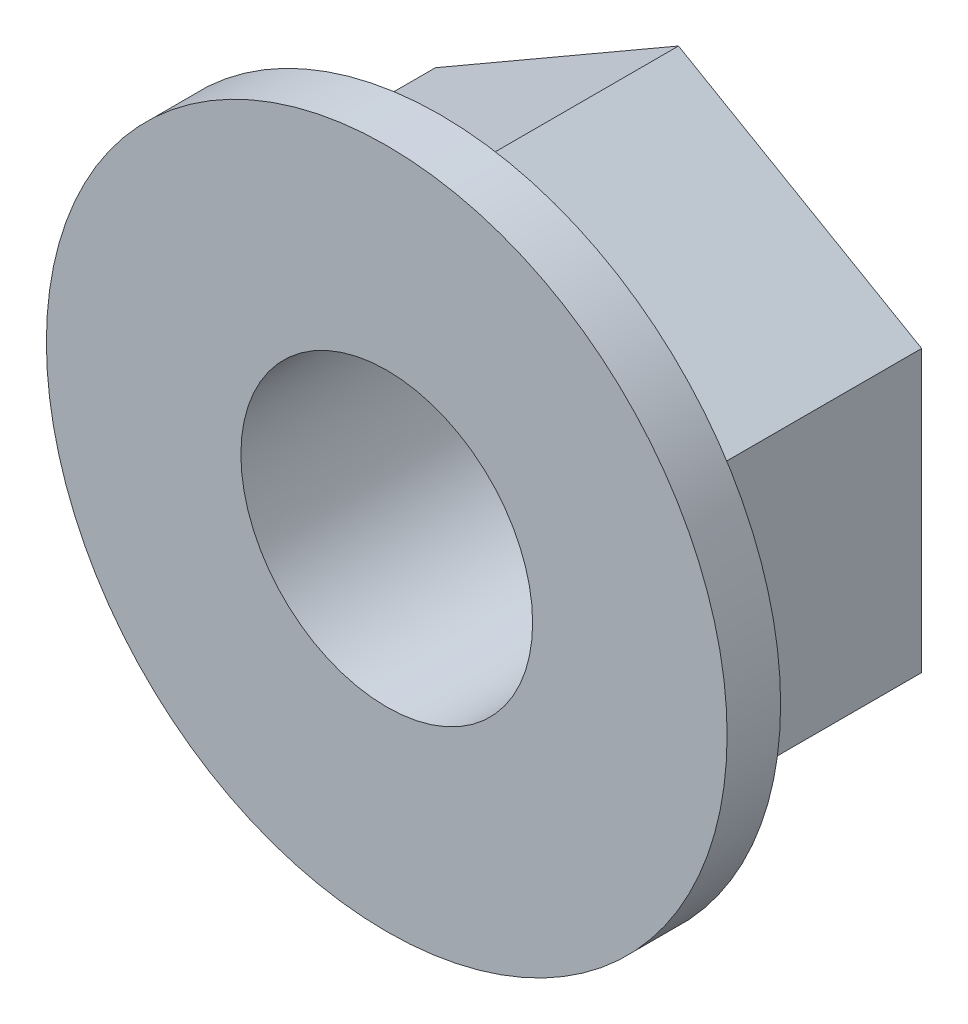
ISO-10303-21;
HEADER;
FILE_DESCRIPTION(('STEP AP214'),'2;1');
FILE_NAME('part.step','',(''),(''),'','','');
FILE_SCHEMA(('AUTOMOTIVE_DESIGN { 1 0 10303 214 1 1 1 1 }'));
ENDSEC;
DATA;
#1=APPLICATION_CONTEXT('core data for automotive mechanical design processes');
#2=APPLICATION_PROTOCOL_DEFINITION('international standard','automotive_design',2000,#1);
#3=PRODUCT_CONTEXT('',#1,'mechanical');
#4=PRODUCT('Part','Part','',(#3));
#5=PRODUCT_RELATED_PRODUCT_CATEGORY('part','',(#4));
#6=PRODUCT_DEFINITION_FORMATION('','',#4);
#7=PRODUCT_DEFINITION_CONTEXT('part definition',#1,'design');
#8=PRODUCT_DEFINITION('design','',#6,#7);
#9=PRODUCT_DEFINITION_SHAPE('','',#8);
#10=(LENGTH_UNIT() NAMED_UNIT(*) SI_UNIT(.MILLI.,.METRE.));
#11=(NAMED_UNIT(*) PLANE_ANGLE_UNIT() SI_UNIT($,.RADIAN.));
#12=(NAMED_UNIT(*) SI_UNIT($,.STERADIAN.) SOLID_ANGLE_UNIT());
#13=UNCERTAINTY_MEASURE_WITH_UNIT(LENGTH_MEASURE(1.E-05),#10,'distance_accuracy_value','');
#14=(GEOMETRIC_REPRESENTATION_CONTEXT(3) GLOBAL_UNCERTAINTY_ASSIGNED_CONTEXT((#13)) GLOBAL_UNIT_ASSIGNED_CONTEXT((#10,
#11,#12)) REPRESENTATION_CONTEXT('',''));
#15=CARTESIAN_POINT('',(0.,0.,0.));
#16=DIRECTION('',(0.,0.,1.));
#17=DIRECTION('',(1.,0.,0.));
#18=AXIS2_PLACEMENT_3D('',#15,#16,#17);
#19=CARTESIAN_POINT('',(0.,5.77350269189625,-6.));
#20=DIRECTION('',(0.5,0.866025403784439,0.));
#21=DIRECTION('',(-0.866025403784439,0.5,0.));
#22=AXIS2_PLACEMENT_3D('',#19,#20,#21);
#23=PLANE('',#22);
#24=CARTESIAN_POINT('',(5.00000005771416,2.88675131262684,-1.808118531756));
#25=CARTESIAN_POINT('',(4.78026883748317,3.01361319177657,-1.88137514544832));
#26=CARTESIAN_POINT('',(4.55865824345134,3.14156012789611,-1.94800457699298));
#27=CARTESIAN_POINT('',(4.1115999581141,3.39966934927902,-2.06430484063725));
#28=CARTESIAN_POINT('',(3.88614432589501,3.52983621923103,-2.1139345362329));
#29=CARTESIAN_POINT('',(3.43799269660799,3.78857668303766,-2.19117421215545));
#30=CARTESIAN_POINT('',(3.215366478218,3.91710999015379,-2.21929871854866));
#31=CARTESIAN_POINT('',(2.880644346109,4.11036190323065,-2.24451527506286));
#32=CARTESIAN_POINT('',(2.76899398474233,4.17482326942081,-2.25009382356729));
#33=CARTESIAN_POINT('',(2.54559018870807,4.30380551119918,-2.25549941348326));
#34=CARTESIAN_POINT('',(2.43383675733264,4.36832638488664,-2.2553266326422));
#35=CARTESIAN_POINT('',(2.1276896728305,4.54508048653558,-2.24693881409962));
#36=CARTESIAN_POINT('',(1.93339754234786,4.65725510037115,-2.23286156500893));
#37=CARTESIAN_POINT('',(1.54610273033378,4.88085986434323,-2.18822908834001));
#38=CARTESIAN_POINT('',(1.35310140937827,4.99228922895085,-2.15765861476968));
#39=CARTESIAN_POINT('',(0.965026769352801,5.21634422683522,-2.08124286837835));
#40=CARTESIAN_POINT('',(0.770002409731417,5.32894159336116,-2.03507390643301));
#41=CARTESIAN_POINT('',(0.382861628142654,5.55245742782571,-1.93028972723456));
#42=CARTESIAN_POINT('',(0.190740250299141,5.66337875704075,-1.87169911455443));
#43=CARTESIAN_POINT('',(8.41086587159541E-08,5.7735026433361,-1.80811857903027));
#44=B_SPLINE_CURVE_WITH_KNOTS('',3,(#24,#25,#26,#27,#28,#29,#30,#31,#32,#33,#34,#35,#36,#37,#38,
#39,#40,#41,#42,#43),.UNSPECIFIED.,.F.,.F.,(4,2,2,2,2,2,2,2,2,4),(0.,0.792540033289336,
1.58698455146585,2.36176902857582,2.7487873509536,3.13579371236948,3.8094609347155,
4.4837519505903,5.1729955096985,5.86088637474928),.UNSPECIFIED.);
#45=CARTESIAN_POINT('',(5.00000002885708,2.88675132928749,-1.80811854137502));
#46=VERTEX_POINT('',#45);
#47=CARTESIAN_POINT('',(2.88463729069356E-08,5.77350270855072,-1.80811854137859));
#48=VERTEX_POINT('',#47);
#49=EDGE_CURVE('E20',#46,#48,#44,.T.);
#50=ORIENTED_EDGE('',*,*,#49,.F.);
#51=DIRECTION('',(0.,0.,-1.));
#52=VECTOR('',#51,1.);
#53=CARTESIAN_POINT('',(5.,2.88675134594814,-6.));
#54=LINE('',#53,#52);
#55=CARTESIAN_POINT('',(5.,2.88675134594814,-6.));
#56=VERTEX_POINT('',#55);
#57=EDGE_CURVE('E90',#56,#46,#54,.F.);
#58=ORIENTED_EDGE('',*,*,#57,.F.);
#59=DIRECTION('',(-0.866025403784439,0.499999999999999,0.));
#60=VECTOR('',#59,1.);
#61=CARTESIAN_POINT('',(5.,2.88675134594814,-6.));
#62=LINE('',#61,#60);
#63=CARTESIAN_POINT('',(0.,5.77350269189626,-6.));
#64=VERTEX_POINT('',#63);
#65=EDGE_CURVE('E89',#56,#64,#62,.T.);
#66=ORIENTED_EDGE('',*,*,#65,.T.);
#67=DIRECTION('',(0.,0.,1.));
#68=VECTOR('',#67,1.);
#69=CARTESIAN_POINT('',(0.,5.77350269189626,-6.));
#70=LINE('',#69,#68);
#71=EDGE_CURVE('E59',#48,#64,#70,.F.);
#72=ORIENTED_EDGE('',*,*,#71,.F.);
#73=EDGE_LOOP('',(#50,#58,#66,#72));
#74=FACE_BOUND('',#73,.T.);
#75=ADVANCED_FACE('F16',(#74),#23,.T.);
#76=CARTESIAN_POINT('',(-5.,2.88675134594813,-6.));
#77=DIRECTION('',(-0.5,0.866025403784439,0.));
#78=DIRECTION('',(-0.866025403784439,-0.5,0.));
#79=AXIS2_PLACEMENT_3D('',#76,#77,#78);
#80=PLANE('',#79);
#81=CARTESIAN_POINT('',(5.76927450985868E-08,5.77350272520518,-1.80811853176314));
#82=CARTESIAN_POINT('',(-0.219731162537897,5.64664084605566,-1.88137514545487));
#83=CARTESIAN_POINT('',(-0.441341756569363,5.51869390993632,-1.94800457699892));
#84=CARTESIAN_POINT('',(-0.888400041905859,5.26058468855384,-2.0643048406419));
#85=CARTESIAN_POINT('',(-1.11385567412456,5.13041781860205,-2.11393453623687));
#86=CARTESIAN_POINT('',(-1.5620073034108,4.87167735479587,-2.1911742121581));
#87=CARTESIAN_POINT('',(-1.7846335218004,4.74314404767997,-2.21929871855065));
#88=CARTESIAN_POINT('',(-2.11935565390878,4.54989213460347,-2.24451527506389));
#89=CARTESIAN_POINT('',(-2.23100601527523,4.48543076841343,-2.25009382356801));
#90=CARTESIAN_POINT('',(-2.45440981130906,4.35644852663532,-2.25549941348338));
#91=CARTESIAN_POINT('',(-2.56616324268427,4.29192765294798,-2.25532663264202));
#92=CARTESIAN_POINT('',(-2.87231032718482,4.11517355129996,-2.2469388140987));
#93=CARTESIAN_POINT('',(-3.06660245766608,4.00299893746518,-2.23286156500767));
#94=CARTESIAN_POINT('',(-3.4538972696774,3.7793941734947,-2.18822908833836));
#95=CARTESIAN_POINT('',(-3.64689859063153,3.66796480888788,-2.15765861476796));
#96=CARTESIAN_POINT('',(-4.03497323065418,3.44390981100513,-2.08124286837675));
#97=CARTESIAN_POINT('',(-4.22999759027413,3.33131244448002,-2.03507390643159));
#98=CARTESIAN_POINT('',(-4.61713837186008,3.10779661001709,-1.93028972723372));
#99=CARTESIAN_POINT('',(-4.80925974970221,2.99687528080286,-1.87169911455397));
#100=CARTESIAN_POINT('',(-4.99999991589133,2.8867513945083,-1.80811857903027));
#101=B_SPLINE_CURVE_WITH_KNOTS('',3,(#81,#82,#83,#84,#85,#86,#87,#88,#89,#90,#91,#92,#93,#94,
#95,#96,#97,#98,#99,#100),.UNSPECIFIED.,.F.,.F.,(4,2,2,2,2,2,2,2,2,4),(0.,0.792540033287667,
1.58698455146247,2.36176902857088,2.74878735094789,3.135793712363,3.80946093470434,
4.48375195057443,5.17299550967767,5.86088637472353),.UNSPECIFIED.);
#102=CARTESIAN_POINT('',(-5.,2.88675137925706,-1.80811854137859));
#103=VERTEX_POINT('',#102);
#104=EDGE_CURVE('E97',#48,#103,#101,.T.);
#105=ORIENTED_EDGE('',*,*,#104,.F.);
#106=ORIENTED_EDGE('',*,*,#71,.T.);
#107=DIRECTION('',(-0.866025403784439,-0.5,0.));
#108=VECTOR('',#107,1.);
#109=CARTESIAN_POINT('',(0.,5.77350269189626,-6.));
#110=LINE('',#109,#108);
#111=CARTESIAN_POINT('',(-5.,2.88675134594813,-6.));
#112=VERTEX_POINT('',#111);
#113=EDGE_CURVE('E86',#64,#112,#110,.T.);
#114=ORIENTED_EDGE('',*,*,#113,.T.);
#115=DIRECTION('',(0.,0.,1.));
#116=VECTOR('',#115,1.);
#117=CARTESIAN_POINT('',(-5.,2.88675134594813,-6.));
#118=LINE('',#117,#116);
#119=EDGE_CURVE('E98',#103,#112,#118,.F.);
#120=ORIENTED_EDGE('',*,*,#119,.F.);
#121=EDGE_LOOP('',(#105,#106,#114,#120));
#122=FACE_BOUND('',#121,.T.);
#123=ADVANCED_FACE('F95',(#122),#80,.T.);
#124=CARTESIAN_POINT('',(-5.,-2.88675134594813,-6.));
#125=DIRECTION('',(-1.,0.,0.));
#126=DIRECTION('',(0.,0.,1.));
#127=AXIS2_PLACEMENT_3D('',#124,#125,#126);
#128=PLANE('',#127);
#129=CARTESIAN_POINT('',(-5.,2.88675141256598,-1.80811853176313));
#130=CARTESIAN_POINT('',(-5.,2.64977774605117,-1.87653409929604));
#131=CARTESIAN_POINT('',(-5.,2.41092940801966,-1.93917048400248));
#132=CARTESIAN_POINT('',(-5.,1.92935280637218,-2.04987252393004));
#133=CARTESIAN_POINT('',(-5.,1.68661711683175,-2.09790557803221));
#134=CARTESIAN_POINT('',(-5.,1.20386944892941,-2.17514854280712));
#135=CARTESIAN_POINT('',(-5.,0.963925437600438,-2.20477028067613));
#136=CARTESIAN_POINT('',(-5.,0.482653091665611,-2.24453570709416));
#137=CARTESIAN_POINT('',(-5.,0.241326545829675,-2.25470053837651));
#138=CARTESIAN_POINT('',(-5.,-0.241326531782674,-2.25470053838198));
#139=CARTESIAN_POINT('',(-5.,-0.482653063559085,-2.24453570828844));
#140=CARTESIAN_POINT('',(-5.,-0.963925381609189,-2.20477028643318));
#141=CARTESIAN_POINT('',(-5.,-1.20386937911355,-2.1751485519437));
#142=CARTESIAN_POINT('',(-5.,-1.68661701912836,-2.09790559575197));
#143=CARTESIAN_POINT('',(-5.,-1.92935269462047,-2.04987254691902));
#144=CARTESIAN_POINT('',(-5.,-2.41092926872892,-1.93917051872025));
#145=CARTESIAN_POINT('',(-5.,-2.64977759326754,-1.87653414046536));
#146=CARTESIAN_POINT('',(-5.,-2.88675124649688,-1.80811857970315));
#147=B_SPLINE_CURVE_WITH_KNOTS('',3,(#129,#130,#131,#132,#133,#134,#135,#136,#137,#138,#139,
#140,#141,#142,#143,#144,#145,#146),.UNSPECIFIED.,.F.,.F.,(4,2,2,2,2,2,2,2,4),(0.,
0.740183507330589,1.48200750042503,2.20657720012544,2.93035910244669,3.65414096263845,
4.37871062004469,5.12053456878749,5.86071803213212),.UNSPECIFIED.);
#148=CARTESIAN_POINT('',(-5.00000002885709,-2.88675132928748,-1.80811854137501));
#149=VERTEX_POINT('',#148);
#150=EDGE_CURVE('E157',#103,#149,#147,.T.);
#151=ORIENTED_EDGE('',*,*,#150,.F.);
#152=ORIENTED_EDGE('',*,*,#119,.T.);
#153=DIRECTION('',(0.,-1.,0.));
#154=VECTOR('',#153,1.);
#155=CARTESIAN_POINT('',(-5.,0.,-6.));
#156=LINE('',#155,#154);
#157=CARTESIAN_POINT('',(-5.,-2.88675134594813,-6.));
#158=VERTEX_POINT('',#157);
#159=EDGE_CURVE('E103',#112,#158,#156,.T.);
#160=ORIENTED_EDGE('',*,*,#159,.T.);
#161=DIRECTION('',(0.,0.,1.));
#162=VECTOR('',#161,1.);
#163=CARTESIAN_POINT('',(-5.00000000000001,-2.88675134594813,-6.));
#164=LINE('',#163,#162);
#165=EDGE_CURVE('E216',#149,#158,#164,.F.);
#166=ORIENTED_EDGE('',*,*,#165,.F.);
#167=EDGE_LOOP('',(#151,#152,#160,#166));
#168=FACE_BOUND('',#167,.T.);
#169=ADVANCED_FACE('F165',(#168),#128,.T.);
#170=CARTESIAN_POINT('',(0.,-5.77350269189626,-6.));
#171=DIRECTION('',(-0.5,-0.866025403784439,0.));
#172=DIRECTION('',(0.866025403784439,-0.5,0.));
#173=AXIS2_PLACEMENT_3D('',#170,#171,#172);
#174=PLANE('',#173);
#175=CARTESIAN_POINT('',(-5.00000003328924,-2.88675128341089,-1.80811850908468));
#176=CARTESIAN_POINT('',(-4.78026882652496,-3.01361318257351,-1.88137513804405));
#177=CARTESIAN_POINT('',(-4.55865823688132,-3.14156012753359,-1.94800457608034));
#178=CARTESIAN_POINT('',(-4.11159995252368,-3.39966935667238,-2.06430484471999));
#179=CARTESIAN_POINT('',(-3.88614431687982,-3.52983622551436,-2.11393453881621));
#180=CARTESIAN_POINT('',(-3.43799268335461,-3.7885766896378,-2.1911742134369));
#181=CARTESIAN_POINT('',(-3.21536646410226,-3.91710999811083,-2.21929872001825));
#182=CARTESIAN_POINT('',(-2.88064433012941,-4.11036191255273,-2.24451527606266));
#183=CARTESIAN_POINT('',(-2.76899396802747,-4.1748232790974,-2.25009382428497));
#184=CARTESIAN_POINT('',(-2.54559017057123,-4.30380552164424,-2.255499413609));
#185=CARTESIAN_POINT('',(-2.43383673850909,-4.36832639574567,-2.25532663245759));
#186=CARTESIAN_POINT('',(-2.12768964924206,-4.54508050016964,-2.2469388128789));
#187=CARTESIAN_POINT('',(-1.93339751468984,-4.65725511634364,-2.23286156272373));
#188=CARTESIAN_POINT('',(-1.54610269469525,-4.88085988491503,-2.18822908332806));
#189=CARTESIAN_POINT('',(-1.35310136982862,-4.99228925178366,-2.15765860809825));
#190=CARTESIAN_POINT('',(-0.965026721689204,-5.21634425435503,-2.08124285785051));
#191=CARTESIAN_POINT('',(-0.77000235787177,-5.32894162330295,-2.03507389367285));
#192=CARTESIAN_POINT('',(-0.382861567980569,-5.55245746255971,-1.9302897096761));
#193=CARTESIAN_POINT('',(-0.190740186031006,-5.66337879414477,-1.87169909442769));
#194=CARTESIAN_POINT('',(-1.57906232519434E-08,-5.77350268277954,-1.80811855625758));
#195=B_SPLINE_CURVE_WITH_KNOTS('',3,(#175,#176,#177,#178,#179,#180,#181,#182,#183,#184,#185,
#186,#187,#188,#189,#190,#191,#192,#193,#194),.UNSPECIFIED.,.F.,.F.,(4,2,2,2,2,2,2,2,2,4),(0.,
0.792540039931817,1.58698456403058,2.36176904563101,2.74878737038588,3.13579373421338,
3.80946097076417,4.48375200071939,5.17299557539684,5.86088645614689),.UNSPECIFIED.);
#196=CARTESIAN_POINT('',(7.100646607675E-09,-5.77350268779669,-1.80811855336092));
#197=VERTEX_POINT('',#196);
#198=EDGE_CURVE('E143',#149,#197,#195,.T.);
#199=ORIENTED_EDGE('',*,*,#198,.F.);
#200=ORIENTED_EDGE('',*,*,#165,.T.);
#201=DIRECTION('',(0.866025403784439,-0.5,0.));
#202=VECTOR('',#201,1.);
#203=CARTESIAN_POINT('',(-5.,-2.88675134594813,-6.));
#204=LINE('',#203,#202);
#205=CARTESIAN_POINT('',(0.,-5.77350269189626,-6.));
#206=VERTEX_POINT('',#205);
#207=EDGE_CURVE('E105',#158,#206,#204,.T.);
#208=ORIENTED_EDGE('',*,*,#207,.T.);
#209=DIRECTION('',(0.,0.,1.));
#210=VECTOR('',#209,1.);
#211=CARTESIAN_POINT('',(0.,-5.77350269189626,-6.));
#212=LINE('',#211,#210);
#213=EDGE_CURVE('E212',#197,#206,#212,.F.);
#214=ORIENTED_EDGE('',*,*,#213,.F.);
#215=EDGE_LOOP('',(#199,#200,#208,#214));
#216=FACE_BOUND('',#215,.T.);
#217=ADVANCED_FACE('F168',(#216),#174,.T.);
#218=CARTESIAN_POINT('',(5.,-2.88675134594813,-6.));
#219=DIRECTION('',(0.5,-0.866025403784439,0.));
#220=DIRECTION('',(0.866025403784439,0.5,0.));
#221=AXIS2_PLACEMENT_3D('',#218,#219,#220);
#222=PLANE('',#221);
#223=CARTESIAN_POINT('',(1.0175316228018E-08,-5.77350267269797,-1.80811854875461));
#224=CARTESIAN_POINT('',(0.219731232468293,-5.6466408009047,-1.8813751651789));
#225=CARTESIAN_POINT('',(0.441341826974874,-5.51869386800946,-1.94800459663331));
#226=CARTESIAN_POINT('',(0.888400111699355,-5.26058464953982,-2.06430485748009));
#227=CARTESIAN_POINT('',(1.1138557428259,-5.130417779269,-2.11393455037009));
#228=CARTESIAN_POINT('',(1.5620073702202,-4.87167731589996,-2.19117422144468));
#229=CARTESIAN_POINT('',(1.78463358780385,-4.74314400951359,-2.21929872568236));
#230=CARTESIAN_POINT('',(2.11935571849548,-4.54989209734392,-2.24451527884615));
#231=CARTESIAN_POINT('',(2.23100607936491,-4.48543073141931,-2.25009382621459));
#232=CARTESIAN_POINT('',(2.45440987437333,-4.35644849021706,-2.25549941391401));
#233=CARTESIAN_POINT('',(2.56616330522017,-4.29192761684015,-2.25532663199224));
#234=CARTESIAN_POINT('',(2.87231038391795,-4.11517351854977,-2.24693881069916));
#235=CARTESIAN_POINT('',(3.06660250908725,-4.00299890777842,-2.23286156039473));
#236=CARTESIAN_POINT('',(3.45389731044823,-3.77939414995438,-2.18822908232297));
#237=CARTESIAN_POINT('',(3.64689862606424,-3.66796478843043,-2.15765860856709));
#238=CARTESIAN_POINT('',(4.03497325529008,-3.44390979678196,-2.08124286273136));
#239=CARTESIAN_POINT('',(4.22999760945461,-3.33131243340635,-2.0350739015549));
#240=CARTESIAN_POINT('',(4.6171383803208,-3.1077966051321,-1.93028972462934));
#241=CARTESIAN_POINT('',(4.80925975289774,-2.99687527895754,-1.87169911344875));
#242=CARTESIAN_POINT('',(4.99999991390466,-2.88675139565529,-1.80811857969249));
#243=B_SPLINE_CURVE_WITH_KNOTS('',3,(#223,#224,#225,#226,#227,#228,#229,#230,#231,#232,#233,
#234,#235,#236,#237,#238,#239,#240,#241,#242),.UNSPECIFIED.,.F.,.F.,(4,2,2,2,2,2,2,2,2,4),(0.,
0.792540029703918,1.58698454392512,2.36176901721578,2.74878733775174,3.1357936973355,
3.80946090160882,4.48375189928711,5.17299543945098,5.86088628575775),.UNSPECIFIED.);
#244=CARTESIAN_POINT('',(5.,-2.88675137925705,-1.80811854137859));
#245=VERTEX_POINT('',#244);
#246=EDGE_CURVE('E125',#197,#245,#243,.T.);
#247=ORIENTED_EDGE('',*,*,#246,.F.);
#248=ORIENTED_EDGE('',*,*,#213,.T.);
#249=DIRECTION('',(0.866025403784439,0.5,0.));
#250=VECTOR('',#249,1.);
#251=CARTESIAN_POINT('',(0.,-5.77350269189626,-6.));
#252=LINE('',#251,#250);
#253=CARTESIAN_POINT('',(5.,-2.88675134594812,-6.));
#254=VERTEX_POINT('',#253);
#255=EDGE_CURVE('E72',#206,#254,#252,.T.);
#256=ORIENTED_EDGE('',*,*,#255,.T.);
#257=DIRECTION('',(0.,0.,-1.));
#258=VECTOR('',#257,1.);
#259=CARTESIAN_POINT('',(5.,-2.88675134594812,-6.));
#260=LINE('',#259,#258);
#261=EDGE_CURVE('E40',#245,#254,#260,.T.);
#262=ORIENTED_EDGE('',*,*,#261,.F.);
#263=EDGE_LOOP('',(#247,#248,#256,#262));
#264=FACE_BOUND('',#263,.T.);
#265=ADVANCED_FACE('F172',(#264),#222,.T.);
#266=CARTESIAN_POINT('',(5.,2.88675134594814,-6.));
#267=DIRECTION('',(1.,0.,0.));
#268=DIRECTION('',(0.,0.,-1.));
#269=AXIS2_PLACEMENT_3D('',#266,#267,#268);
#270=PLANE('',#269);
#271=CARTESIAN_POINT('',(4.99999996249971,-2.88675140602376,-1.80811850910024));
#272=CARTESIAN_POINT('',(4.99999998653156,-2.64977774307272,-1.8765340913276));
#273=CARTESIAN_POINT('',(4.99999999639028,-2.41092940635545,-1.93917048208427));
#274=CARTESIAN_POINT('',(5.00000000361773,-1.92935280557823,-2.04987252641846));
#275=CARTESIAN_POINT('',(5.00000000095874,-1.68661711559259,-2.09790557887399));
#276=CARTESIAN_POINT('',(4.99999999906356,-1.2038694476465,-2.17514854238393));
#277=CARTESIAN_POINT('',(4.9999999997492,-0.963925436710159,-2.20477028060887));
#278=CARTESIAN_POINT('',(5.00000000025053,-0.482653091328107,-2.24453570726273));
#279=CARTESIAN_POINT('',(5.00000000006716,-0.241326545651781,-2.25470053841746));
#280=CARTESIAN_POINT('',(4.99999999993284,0.241326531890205,-2.25470053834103));
#281=CARTESIAN_POINT('',(4.9999999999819,0.482653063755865,-2.24453570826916));
#282=CARTESIAN_POINT('',(5.00000000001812,0.963925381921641,-2.20477028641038));
#283=CARTESIAN_POINT('',(5.00000000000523,1.20386937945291,-2.17514855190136));
#284=CARTESIAN_POINT('',(4.99999999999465,1.68661701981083,-2.09790559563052));
#285=CARTESIAN_POINT('',(4.99999999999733,1.92935269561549,-2.04987254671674));
#286=CARTESIAN_POINT('',(5.00000000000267,2.41092927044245,-1.93917051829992));
#287=CARTESIAN_POINT('',(5.00000000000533,2.64977759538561,-1.87653413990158));
#288=CARTESIAN_POINT('',(5.,2.88675124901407,-1.8081185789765));
#289=B_SPLINE_CURVE_WITH_KNOTS('',3,(#271,#272,#273,#274,#275,#276,#277,#278,#279,#280,#281,
#282,#283,#284,#285,#286,#287,#288),.UNSPECIFIED.,.F.,.F.,(4,2,2,2,2,2,2,2,4),(0.,
0.740183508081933,1.48200750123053,2.20657720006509,2.93035910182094,3.65414096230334,
4.37871061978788,5.12053456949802,5.86071803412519),.UNSPECIFIED.);
#290=EDGE_CURVE('E66',#245,#46,#289,.T.);
#291=ORIENTED_EDGE('',*,*,#290,.F.);
#292=ORIENTED_EDGE('',*,*,#261,.T.);
#293=DIRECTION('',(0.,-1.,0.));
#294=VECTOR('',#293,1.);
#295=CARTESIAN_POINT('',(5.,0.,-6.));
#296=LINE('',#295,#294);
#297=EDGE_CURVE('E229',#254,#56,#296,.F.);
#298=ORIENTED_EDGE('',*,*,#297,.T.);
#299=ORIENTED_EDGE('',*,*,#57,.T.);
#300=EDGE_LOOP('',(#291,#292,#298,#299));
#301=FACE_BOUND('',#300,.T.);
#302=ADVANCED_FACE('F132',(#301),#270,.T.);
#303=CARTESIAN_POINT('',(0.,0.,-6.));
#304=DIRECTION('',(0.,0.,1.));
#305=DIRECTION('',(0.,-1.,0.));
#306=AXIS2_PLACEMENT_3D('',#303,#304,#305);
#307=PLANE('',#306);
#308=CARTESIAN_POINT('',(0.,0.,-6.00000000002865));
#309=DIRECTION('',(0.,0.,-1.));
#310=DIRECTION('',(0.,1.,0.));
#311=AXIS2_PLACEMENT_3D('',#308,#309,#310);
#312=CIRCLE('',#311,3.49999999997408);
#313=CARTESIAN_POINT('',(0.,3.49999999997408,-6.00000000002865));
#314=VERTEX_POINT('',#313);
#315=EDGE_CURVE('E115',#314,#314,#312,.F.);
#316=ORIENTED_EDGE('',*,*,#315,.T.);
#317=EDGE_LOOP('',(#316));
#318=FACE_BOUND('',#317,.T.);
#319=ORIENTED_EDGE('',*,*,#255,.F.);
#320=ORIENTED_EDGE('',*,*,#207,.F.);
#321=ORIENTED_EDGE('',*,*,#159,.F.);
#322=ORIENTED_EDGE('',*,*,#113,.F.);
#323=ORIENTED_EDGE('',*,*,#65,.F.);
#324=ORIENTED_EDGE('',*,*,#297,.F.);
#325=EDGE_LOOP('',(#319,#320,#321,#322,#323,#324));
#326=FACE_BOUND('',#325,.T.);
#327=ADVANCED_FACE('F101',(#318,#326),#307,.F.);
#328=CARTESIAN_POINT('',(0.,0.,-1.1));
#329=DIRECTION('',(0.,0.,1.));
#330=DIRECTION('',(0.,-1.,0.));
#331=AXIS2_PLACEMENT_3D('',#328,#329,#330);
#332=CONICAL_SURFACE('',#331,7.,1.0471975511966);
#333=ORIENTED_EDGE('',*,*,#104,.T.);
#334=ORIENTED_EDGE('',*,*,#150,.T.);
#335=ORIENTED_EDGE('',*,*,#198,.T.);
#336=ORIENTED_EDGE('',*,*,#246,.T.);
#337=ORIENTED_EDGE('',*,*,#290,.T.);
#338=ORIENTED_EDGE('',*,*,#49,.T.);
#339=EDGE_LOOP('',(#333,#334,#335,#336,#337,#338));
#340=FACE_BOUND('',#339,.T.);
#341=CARTESIAN_POINT('',(0.,0.,-1.1));
#342=DIRECTION('',(0.,0.,1.));
#343=DIRECTION('',(0.,-1.,0.));
#344=AXIS2_PLACEMENT_3D('',#341,#342,#343);
#345=CIRCLE('',#344,7.);
#346=CARTESIAN_POINT('',(0.,-7.,-1.1));
#347=VERTEX_POINT('',#346);
#348=EDGE_CURVE('E118',#347,#347,#345,.T.);
#349=ORIENTED_EDGE('',*,*,#348,.F.);
#350=EDGE_LOOP('',(#349));
#351=FACE_BOUND('',#350,.T.);
#352=ADVANCED_FACE('F135',(#340,#351),#332,.T.);
#353=CARTESIAN_POINT('',(0.,0.,-6.00000000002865));
#354=DIRECTION('',(0.,0.,-1.));
#355=DIRECTION('',(0.,1.,0.));
#356=AXIS2_PLACEMENT_3D('',#353,#354,#355);
#357=CONICAL_SURFACE('',#356,3.49999999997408,0.785398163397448);
#358=CARTESIAN_POINT('',(0.,0.,-5.5));
#359=DIRECTION('',(0.,0.,-1.));
#360=DIRECTION('',(0.,1.,0.));
#361=AXIS2_PLACEMENT_3D('',#358,#359,#360);
#362=CIRCLE('',#361,3.);
#363=CARTESIAN_POINT('',(0.,3.00000000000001,-5.5));
#364=VERTEX_POINT('',#363);
#365=EDGE_CURVE('E114',#364,#364,#362,.F.);
#366=ORIENTED_EDGE('',*,*,#365,.T.);
#367=EDGE_LOOP('',(#366));
#368=FACE_BOUND('',#367,.T.);
#369=ORIENTED_EDGE('',*,*,#315,.F.);
#370=EDGE_LOOP('',(#369));
#371=FACE_BOUND('',#370,.T.);
#372=ADVANCED_FACE('F139',(#368,#371),#357,.F.);
#373=CARTESIAN_POINT('',(0.,0.,-6.3));
#374=DIRECTION('',(0.,0.,1.));
#375=DIRECTION('',(0.,-1.,0.));
#376=AXIS2_PLACEMENT_3D('',#373,#374,#375);
#377=CYLINDRICAL_SURFACE('',#376,7.);
#378=ORIENTED_EDGE('',*,*,#348,.T.);
#379=EDGE_LOOP('',(#378));
#380=FACE_BOUND('',#379,.T.);
#381=CARTESIAN_POINT('',(0.,0.,0.));
#382=DIRECTION('',(0.,0.,1.));
#383=DIRECTION('',(0.,-1.,0.));
#384=AXIS2_PLACEMENT_3D('',#381,#382,#383);
#385=CIRCLE('',#384,7.);
#386=CARTESIAN_POINT('',(0.,-7.,0.));
#387=VERTEX_POINT('',#386);
#388=EDGE_CURVE('E31',#387,#387,#385,.T.);
#389=ORIENTED_EDGE('',*,*,#388,.F.);
#390=EDGE_LOOP('',(#389));
#391=FACE_BOUND('',#390,.T.);
#392=ADVANCED_FACE('F189',(#380,#391),#377,.T.);
#393=CARTESIAN_POINT('',(0.,0.,16.));
#394=DIRECTION('',(0.,0.,-1.));
#395=DIRECTION('',(0.,1.,0.));
#396=AXIS2_PLACEMENT_3D('',#393,#394,#395);
#397=CYLINDRICAL_SURFACE('',#396,3.);
#398=CARTESIAN_POINT('',(0.,0.,0.));
#399=DIRECTION('',(0.,0.,-1.));
#400=DIRECTION('',(0.,1.,0.));
#401=AXIS2_PLACEMENT_3D('',#398,#399,#400);
#402=CIRCLE('',#401,3.);
#403=CARTESIAN_POINT('',(0.,3.00000000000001,0.));
#404=VERTEX_POINT('',#403);
#405=EDGE_CURVE('E10',#404,#404,#402,.T.);
#406=ORIENTED_EDGE('',*,*,#405,.F.);
#407=EDGE_LOOP('',(#406));
#408=FACE_BOUND('',#407,.T.);
#409=ORIENTED_EDGE('',*,*,#365,.F.);
#410=EDGE_LOOP('',(#409));
#411=FACE_BOUND('',#410,.T.);
#412=ADVANCED_FACE('F183',(#408,#411),#397,.F.);
#413=CARTESIAN_POINT('',(0.,0.,0.));
#414=DIRECTION('',(0.,0.,1.));
#415=DIRECTION('',(0.,-1.,0.));
#416=AXIS2_PLACEMENT_3D('',#413,#414,#415);
#417=PLANE('',#416);
#418=ORIENTED_EDGE('',*,*,#405,.T.);
#419=EDGE_LOOP('',(#418));
#420=FACE_BOUND('',#419,.T.);
#421=ORIENTED_EDGE('',*,*,#388,.T.);
#422=EDGE_LOOP('',(#421));
#423=FACE_BOUND('',#422,.T.);
#424=ADVANCED_FACE('F181',(#420,#423),#417,.T.);
#425=CLOSED_SHELL('',(#75,#123,#169,#217,#265,#302,#327,#352,#372,#392,#412,#424));
#426=MANIFOLD_SOLID_BREP('B1',#425);
#427=ADVANCED_BREP_SHAPE_REPRESENTATION('',(#18,#426),#14);
#428=SHAPE_DEFINITION_REPRESENTATION(#9,#427);
ENDSEC;
END-ISO-10303-21;
